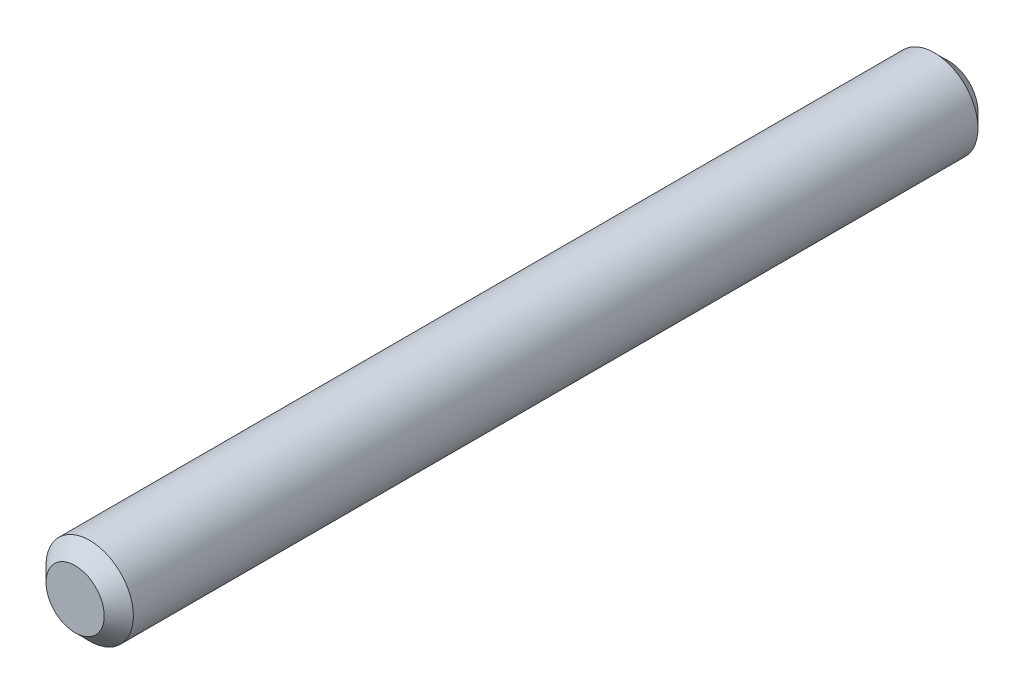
ISO-10303-21;
HEADER;
FILE_DESCRIPTION(('STEP AP214'),'2;1');
FILE_NAME('part.step','',(''),(''),'','','');
FILE_SCHEMA(('AUTOMOTIVE_DESIGN { 1 0 10303 214 1 1 1 1 }'));
ENDSEC;
DATA;
#1=APPLICATION_CONTEXT('core data for automotive mechanical design processes');
#2=APPLICATION_PROTOCOL_DEFINITION('international standard','automotive_design',2000,#1);
#3=PRODUCT_CONTEXT('',#1,'mechanical');
#4=PRODUCT('Part','Part','',(#3));
#5=PRODUCT_RELATED_PRODUCT_CATEGORY('part','',(#4));
#6=PRODUCT_DEFINITION_FORMATION('','',#4);
#7=PRODUCT_DEFINITION_CONTEXT('part definition',#1,'design');
#8=PRODUCT_DEFINITION('design','',#6,#7);
#9=PRODUCT_DEFINITION_SHAPE('','',#8);
#10=(LENGTH_UNIT() NAMED_UNIT(*) SI_UNIT(.MILLI.,.METRE.));
#11=(NAMED_UNIT(*) PLANE_ANGLE_UNIT() SI_UNIT($,.RADIAN.));
#12=(NAMED_UNIT(*) SI_UNIT($,.STERADIAN.) SOLID_ANGLE_UNIT());
#13=UNCERTAINTY_MEASURE_WITH_UNIT(LENGTH_MEASURE(1.E-05),#10,'distance_accuracy_value','');
#14=(GEOMETRIC_REPRESENTATION_CONTEXT(3) GLOBAL_UNCERTAINTY_ASSIGNED_CONTEXT((#13)) GLOBAL_UNIT_ASSIGNED_CONTEXT((#10,
#11,#12)) REPRESENTATION_CONTEXT('',''));
#15=CARTESIAN_POINT('',(0.,0.,0.));
#16=DIRECTION('',(0.,0.,1.));
#17=DIRECTION('',(1.,0.,0.));
#18=AXIS2_PLACEMENT_3D('',#15,#16,#17);
#19=CARTESIAN_POINT('',(0.,0.,15.));
#20=DIRECTION('',(0.,0.,-1.));
#21=DIRECTION('',(-1.,0.,0.));
#22=AXIS2_PLACEMENT_3D('',#19,#20,#21);
#23=CYLINDRICAL_SURFACE('',#22,1.5);
#24=CARTESIAN_POINT('',(0.,0.,-14.5));
#25=DIRECTION('',(0.,0.,1.));
#26=DIRECTION('',(1.,0.,0.));
#27=AXIS2_PLACEMENT_3D('',#24,#25,#26);
#28=CIRCLE('',#27,1.5);
#29=CARTESIAN_POINT('',(1.5,0.,-14.5));
#30=VERTEX_POINT('',#29);
#31=EDGE_CURVE('E44',#30,#30,#28,.T.);
#32=ORIENTED_EDGE('',*,*,#31,.T.);
#33=EDGE_LOOP('',(#32));
#34=FACE_BOUND('',#33,.T.);
#35=CARTESIAN_POINT('',(0.,0.,14.5));
#36=DIRECTION('',(0.,0.,1.));
#37=DIRECTION('',(1.,0.,0.));
#38=AXIS2_PLACEMENT_3D('',#35,#36,#37);
#39=CIRCLE('',#38,1.5);
#40=CARTESIAN_POINT('',(1.5,0.,14.5));
#41=VERTEX_POINT('',#40);
#42=EDGE_CURVE('E48',#41,#41,#39,.F.);
#43=ORIENTED_EDGE('',*,*,#42,.T.);
#44=EDGE_LOOP('',(#43));
#45=FACE_BOUND('',#44,.T.);
#46=ADVANCED_FACE('F33',(#34,#45),#23,.T.);
#47=CARTESIAN_POINT('',(0.,0.,15.));
#48=DIRECTION('',(0.,0.,1.));
#49=DIRECTION('',(1.,0.,0.));
#50=AXIS2_PLACEMENT_3D('',#47,#48,#49);
#51=PLANE('',#50);
#52=CARTESIAN_POINT('',(0.,0.,15.));
#53=DIRECTION('',(0.,0.,1.));
#54=DIRECTION('',(1.,0.,0.));
#55=AXIS2_PLACEMENT_3D('',#52,#53,#54);
#56=CIRCLE('',#55,1.);
#57=CARTESIAN_POINT('',(1.,0.,15.));
#58=VERTEX_POINT('',#57);
#59=EDGE_CURVE('E10',#58,#58,#56,.T.);
#60=ORIENTED_EDGE('',*,*,#59,.T.);
#61=EDGE_LOOP('',(#60));
#62=FACE_BOUND('',#61,.T.);
#63=ADVANCED_FACE('F64',(#62),#51,.T.);
#64=CARTESIAN_POINT('',(0.,0.,-15.));
#65=DIRECTION('',(0.,0.,1.));
#66=DIRECTION('',(1.,0.,0.));
#67=AXIS2_PLACEMENT_3D('',#64,#65,#66);
#68=PLANE('',#67);
#69=CARTESIAN_POINT('',(0.,0.,-15.));
#70=DIRECTION('',(0.,0.,1.));
#71=DIRECTION('',(1.,0.,0.));
#72=AXIS2_PLACEMENT_3D('',#69,#70,#71);
#73=CIRCLE('',#72,1.);
#74=CARTESIAN_POINT('',(1.,0.,-15.));
#75=VERTEX_POINT('',#74);
#76=EDGE_CURVE('E40',#75,#75,#73,.F.);
#77=ORIENTED_EDGE('',*,*,#76,.T.);
#78=EDGE_LOOP('',(#77));
#79=FACE_BOUND('',#78,.T.);
#80=ADVANCED_FACE('F61',(#79),#68,.F.);
#81=CARTESIAN_POINT('',(0.,0.,-14.5));
#82=DIRECTION('',(0.,0.,1.));
#83=DIRECTION('',(1.,0.,0.));
#84=AXIS2_PLACEMENT_3D('',#81,#82,#83);
#85=CONICAL_SURFACE('',#84,1.5,0.78539816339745);
#86=ORIENTED_EDGE('',*,*,#76,.F.);
#87=EDGE_LOOP('',(#86));
#88=FACE_BOUND('',#87,.T.);
#89=ORIENTED_EDGE('',*,*,#31,.F.);
#90=EDGE_LOOP('',(#89));
#91=FACE_BOUND('',#90,.T.);
#92=ADVANCED_FACE('F57',(#88,#91),#85,.T.);
#93=CARTESIAN_POINT('',(0.,0.,15.));
#94=DIRECTION('',(0.,0.,-1.));
#95=DIRECTION('',(-1.,0.,0.));
#96=AXIS2_PLACEMENT_3D('',#93,#94,#95);
#97=CONICAL_SURFACE('',#96,1.,0.78539816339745);
#98=ORIENTED_EDGE('',*,*,#42,.F.);
#99=EDGE_LOOP('',(#98));
#100=FACE_BOUND('',#99,.T.);
#101=ORIENTED_EDGE('',*,*,#59,.F.);
#102=EDGE_LOOP('',(#101));
#103=FACE_BOUND('',#102,.T.);
#104=ADVANCED_FACE('F35',(#100,#103),#97,.T.);
#105=CLOSED_SHELL('',(#46,#63,#80,#92,#104));
#106=MANIFOLD_SOLID_BREP('B2',#105);
#107=ADVANCED_BREP_SHAPE_REPRESENTATION('',(#18,#106),#14);
#108=SHAPE_DEFINITION_REPRESENTATION(#9,#107);
ENDSEC;
END-ISO-10303-21;
